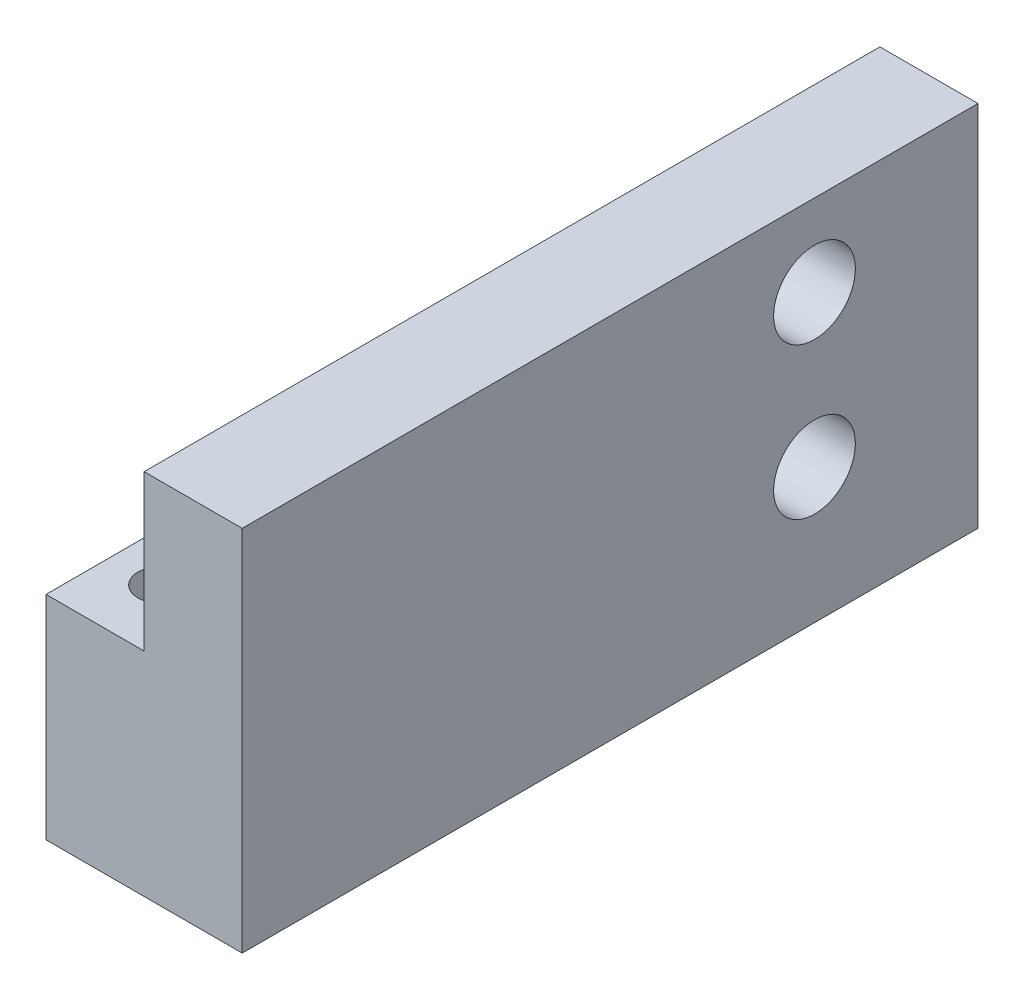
ISO-10303-21;
HEADER;
FILE_DESCRIPTION(('STEP AP214'),'2;1');
FILE_NAME('part.step','',(''),(''),'','','');
FILE_SCHEMA(('AUTOMOTIVE_DESIGN { 1 0 10303 214 1 1 1 1 }'));
ENDSEC;
DATA;
#1=APPLICATION_CONTEXT('core data for automotive mechanical design processes');
#2=APPLICATION_PROTOCOL_DEFINITION('international standard','automotive_design',2000,#1);
#3=PRODUCT_CONTEXT('',#1,'mechanical');
#4=PRODUCT('Part','Part','',(#3));
#5=PRODUCT_RELATED_PRODUCT_CATEGORY('part','',(#4));
#6=PRODUCT_DEFINITION_FORMATION('','',#4);
#7=PRODUCT_DEFINITION_CONTEXT('part definition',#1,'design');
#8=PRODUCT_DEFINITION('design','',#6,#7);
#9=PRODUCT_DEFINITION_SHAPE('','',#8);
#10=(LENGTH_UNIT() NAMED_UNIT(*) SI_UNIT(.MILLI.,.METRE.));
#11=(NAMED_UNIT(*) PLANE_ANGLE_UNIT() SI_UNIT($,.RADIAN.));
#12=(NAMED_UNIT(*) SI_UNIT($,.STERADIAN.) SOLID_ANGLE_UNIT());
#13=UNCERTAINTY_MEASURE_WITH_UNIT(LENGTH_MEASURE(1.E-05),#10,'distance_accuracy_value','');
#14=(GEOMETRIC_REPRESENTATION_CONTEXT(3) GLOBAL_UNCERTAINTY_ASSIGNED_CONTEXT((#13)) GLOBAL_UNIT_ASSIGNED_CONTEXT((#10,
#11,#12)) REPRESENTATION_CONTEXT('',''));
#15=CARTESIAN_POINT('',(0.,0.,0.));
#16=DIRECTION('',(0.,0.,1.));
#17=DIRECTION('',(1.,0.,0.));
#18=AXIS2_PLACEMENT_3D('',#15,#16,#17);
#19=CARTESIAN_POINT('',(-6.,3.5,20.));
#20=DIRECTION('',(0.,1.,0.));
#21=DIRECTION('',(0.,0.,1.));
#22=AXIS2_PLACEMENT_3D('',#19,#20,#21);
#23=CYLINDRICAL_SURFACE('',#22,1.64999999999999);
#24=CARTESIAN_POINT('',(-6.,3.5,20.));
#25=DIRECTION('',(0.,1.,0.));
#26=DIRECTION('',(0.,0.,1.));
#27=AXIS2_PLACEMENT_3D('',#24,#25,#26);
#28=CIRCLE('',#27,1.64999999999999);
#29=CARTESIAN_POINT('',(-6.,3.5,21.65));
#30=VERTEX_POINT('',#29);
#31=EDGE_CURVE('E105',#30,#30,#28,.T.);
#32=ORIENTED_EDGE('',*,*,#31,.T.);
#33=EDGE_LOOP('',(#32));
#34=FACE_BOUND('',#33,.T.);
#35=CARTESIAN_POINT('',(-4.35000000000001,-0.999999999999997,20.));
#36=CARTESIAN_POINT('',(-4.35000378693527,-1.00000272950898,20.0900197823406));
#37=CARTESIAN_POINT('',(-4.35739630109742,-1.00245575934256,20.1800846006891));
#38=CARTESIAN_POINT('',(-4.38670360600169,-1.01201043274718,20.3576091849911));
#39=CARTESIAN_POINT('',(-4.40863108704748,-1.01911613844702,20.4450666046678));
#40=CARTESIAN_POINT('',(-4.46617396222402,-1.03720026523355,20.614724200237));
#41=CARTESIAN_POINT('',(-4.50176272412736,-1.04817114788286,20.696934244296));
#42=CARTESIAN_POINT('',(-4.58551147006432,-1.07286273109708,20.8542035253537));
#43=CARTESIAN_POINT('',(-4.63367179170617,-1.0865835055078,20.9292625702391));
#44=CARTESIAN_POINT('',(-4.74291936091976,-1.11585191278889,21.0726698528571));
#45=CARTESIAN_POINT('',(-4.80435762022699,-1.13144265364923,21.1407418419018));
#46=CARTESIAN_POINT('',(-4.93768628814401,-1.16245793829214,21.2658396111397));
#47=CARTESIAN_POINT('',(-5.00958092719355,-1.17788241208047,21.3228608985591));
#48=CARTESIAN_POINT('',(-5.16426535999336,-1.20729396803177,21.4258059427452));
#49=CARTESIAN_POINT('',(-5.24730704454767,-1.2212276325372,21.4713675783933));
#50=CARTESIAN_POINT('',(-5.42035974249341,-1.24540403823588,21.5477197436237));
#51=CARTESIAN_POINT('',(-5.51036197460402,-1.25565134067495,21.5785285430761));
#52=CARTESIAN_POINT('',(-5.66730933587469,-1.26882758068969,21.6174939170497));
#53=CARTESIAN_POINT('',(-5.73317964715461,-1.27302550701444,21.6296582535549));
#54=CARTESIAN_POINT('',(-5.86602497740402,-1.27866051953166,21.6459123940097));
#55=CARTESIAN_POINT('',(-5.9329998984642,-1.28009784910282,21.6500029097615));
#56=CARTESIAN_POINT('',(-6.08986951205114,-1.28009197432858,21.6499960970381));
#57=CARTESIAN_POINT('',(-6.17978432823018,-1.27749808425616,21.6426273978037));
#58=CARTESIAN_POINT('',(-6.35699665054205,-1.26744328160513,21.6134233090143));
#59=CARTESIAN_POINT('',(-6.44429168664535,-1.25997791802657,21.5915746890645));
#60=CARTESIAN_POINT('',(-6.61360460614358,-1.24111979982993,21.5342620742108));
#61=CARTESIAN_POINT('',(-6.69563371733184,-1.2297357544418,21.4988282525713));
#62=CARTESIAN_POINT('',(-6.85259401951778,-1.2043346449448,21.4154453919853));
#63=CARTESIAN_POINT('',(-6.92752482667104,-1.19031743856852,21.3674956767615));
#64=CARTESIAN_POINT('',(-7.07105050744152,-1.16062576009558,21.2584719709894));
#65=CARTESIAN_POINT('',(-7.13933433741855,-1.14491060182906,21.1969994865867));
#66=CARTESIAN_POINT('',(-7.26484842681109,-1.11393470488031,21.0635104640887));
#67=CARTESIAN_POINT('',(-7.32207483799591,-1.09867412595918,20.9914902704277));
#68=CARTESIAN_POINT('',(-7.42525766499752,-1.06985426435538,20.8366699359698));
#69=CARTESIAN_POINT('',(-7.47088388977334,-1.05634926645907,20.7536389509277));
#70=CARTESIAN_POINT('',(-7.54735861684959,-1.03306105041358,20.5806069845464));
#71=CARTESIAN_POINT('',(-7.57822470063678,-1.02327340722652,20.4906144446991));
#72=CARTESIAN_POINT('',(-7.61733057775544,-1.01070811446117,20.3335211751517));
#73=CARTESIAN_POINT('',(-7.62955663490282,-1.00671495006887,20.2674828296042));
#74=CARTESIAN_POINT('',(-7.6458924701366,-1.00135996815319,20.1343046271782));
#75=CARTESIAN_POINT('',(-7.65000282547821,-0.999997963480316,20.0671648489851));
#76=CARTESIAN_POINT('',(-7.64999621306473,-1.00000272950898,19.9099802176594));
#77=CARTESIAN_POINT('',(-7.64260369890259,-1.00245575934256,19.8199153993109));
#78=CARTESIAN_POINT('',(-7.61329639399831,-1.01201043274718,19.6423908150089));
#79=CARTESIAN_POINT('',(-7.59136891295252,-1.01911613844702,19.5549333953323));
#80=CARTESIAN_POINT('',(-7.53382603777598,-1.03720026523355,19.385275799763));
#81=CARTESIAN_POINT('',(-7.49823727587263,-1.04817114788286,19.303065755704));
#82=CARTESIAN_POINT('',(-7.41448852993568,-1.07286273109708,19.1457964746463));
#83=CARTESIAN_POINT('',(-7.36632820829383,-1.0865835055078,19.0707374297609));
#84=CARTESIAN_POINT('',(-7.25708063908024,-1.11585191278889,18.9273301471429));
#85=CARTESIAN_POINT('',(-7.19564237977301,-1.13144265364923,18.8592581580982));
#86=CARTESIAN_POINT('',(-7.06231371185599,-1.16245793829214,18.7341603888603));
#87=CARTESIAN_POINT('',(-6.99041907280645,-1.17788241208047,18.6771391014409));
#88=CARTESIAN_POINT('',(-6.83573464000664,-1.20729396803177,18.5741940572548));
#89=CARTESIAN_POINT('',(-6.75269295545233,-1.2212276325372,18.5286324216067));
#90=CARTESIAN_POINT('',(-6.57964025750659,-1.24540403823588,18.4522802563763));
#91=CARTESIAN_POINT('',(-6.48963802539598,-1.25565134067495,18.4214714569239));
#92=CARTESIAN_POINT('',(-6.33269066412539,-1.26882758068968,18.3825060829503));
#93=CARTESIAN_POINT('',(-6.26682035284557,-1.27302550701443,18.3703417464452));
#94=CARTESIAN_POINT('',(-6.13397502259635,-1.27866051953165,18.3540876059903));
#95=CARTESIAN_POINT('',(-6.06700010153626,-1.28009784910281,18.3499970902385));
#96=CARTESIAN_POINT('',(-5.91013048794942,-1.28009197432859,18.3500039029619));
#97=CARTESIAN_POINT('',(-5.82021567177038,-1.27749808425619,18.3573726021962));
#98=CARTESIAN_POINT('',(-5.64300334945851,-1.26744328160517,18.3865766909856));
#99=CARTESIAN_POINT('',(-5.5557083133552,-1.25997791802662,18.4084253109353));
#100=CARTESIAN_POINT('',(-5.38639539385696,-1.24111979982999,18.465737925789));
#101=CARTESIAN_POINT('',(-5.30436628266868,-1.22973575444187,18.5011717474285));
#102=CARTESIAN_POINT('',(-5.14740598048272,-1.20433464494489,18.5845546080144));
#103=CARTESIAN_POINT('',(-5.07247517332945,-1.19031743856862,18.6325043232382));
#104=CARTESIAN_POINT('',(-4.92894949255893,-1.16062576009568,18.7415280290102));
#105=CARTESIAN_POINT('',(-4.86066566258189,-1.14491060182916,18.8030005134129));
#106=CARTESIAN_POINT('',(-4.7351515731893,-1.11393470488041,18.9364895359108));
#107=CARTESIAN_POINT('',(-4.67792516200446,-1.09867412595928,19.0085097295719));
#108=CARTESIAN_POINT('',(-4.5747423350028,-1.06985426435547,19.1633300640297));
#109=CARTESIAN_POINT('',(-4.52911611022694,-1.05634926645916,19.2463610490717));
#110=CARTESIAN_POINT('',(-4.45264138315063,-1.03306105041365,19.419393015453));
#111=CARTESIAN_POINT('',(-4.4217752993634,-1.02327340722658,19.5093855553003));
#112=CARTESIAN_POINT('',(-4.38266942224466,-1.0107081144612,19.6664788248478));
#113=CARTESIAN_POINT('',(-4.37044336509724,-1.00671495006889,19.7325171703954));
#114=CARTESIAN_POINT('',(-4.35410752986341,-1.00135996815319,19.8656953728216));
#115=CARTESIAN_POINT('',(-4.34999717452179,-0.999997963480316,19.9328351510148));
#116=CARTESIAN_POINT('',(-4.35000000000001,-0.999999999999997,20.));
#117=B_SPLINE_CURVE_WITH_KNOTS('',3,(#35,#36,#37,#38,#39,#40,#41,#42,#43,#44,#45,#46,#47,#48,
#49,#50,#51,#52,#53,#54,#55,#56,#57,#58,#59,#60,#61,#62,#63,#64,#65,#66,#67,#68,#69,#70,#71,#72,
#73,#74,#75,#76,#77,#78,#79,#80,#81,#82,#83,#84,#85,#86,#87,#88,#89,#90,#91,#92,#93,#94,#95,#96,
#97,#98,#99,#100,#101,#102,#103,#104,#105,#106,#107,#108,#109,#110,#111,#112,#113,#114,#115,
#116),.UNSPECIFIED.,.T.,.F.,(4,2,2,2,2,2,2,2,2,2,2,2,2,2,2,2,2,2,2,2,2,2,2,2,2,2,2,2,2,2,2,2,2,
2,2,2,2,2,2,2,4),(0.,0.269807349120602,0.539850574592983,0.809370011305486,1.07889668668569,
1.35668555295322,1.63458712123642,1.92039970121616,2.20585741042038,2.40668679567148,
2.6074984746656,2.87685400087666,3.14645597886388,3.41546259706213,3.68448375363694,
3.96286239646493,4.24133774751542,4.52702385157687,4.81236880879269,5.01368965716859,
5.21499618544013,5.48480353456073,5.75484676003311,6.02436619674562,6.29389287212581,
6.57168173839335,6.84958330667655,7.13539588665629,7.42085359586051,7.62168298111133,
7.82249466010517,8.09185018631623,8.36145216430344,8.63045878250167,8.89947993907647,
9.17785858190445,9.45633393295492,9.74202003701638,10.0273649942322,10.2286858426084,
10.4299923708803),.UNSPECIFIED.);
#118=CARTESIAN_POINT('',(-4.35000000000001,-0.999999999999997,20.));
#119=VERTEX_POINT('',#118);
#120=EDGE_CURVE('E125',#119,#119,#117,.T.);
#121=ORIENTED_EDGE('',*,*,#120,.T.);
#122=EDGE_LOOP('',(#121));
#123=FACE_BOUND('',#122,.T.);
#124=ADVANCED_FACE('F17',(#34,#123),#23,.F.);
#125=CARTESIAN_POINT('',(-5.99999999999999,-22.5,82.));
#126=DIRECTION('',(0.,1.,0.));
#127=DIRECTION('',(0.,0.,1.));
#128=AXIS2_PLACEMENT_3D('',#125,#126,#127);
#129=CYLINDRICAL_SURFACE('',#128,2.75);
#130=CARTESIAN_POINT('',(-5.99999999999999,-22.5,82.));
#131=DIRECTION('',(0.,1.,0.));
#132=DIRECTION('',(0.,0.,1.));
#133=AXIS2_PLACEMENT_3D('',#130,#131,#132);
#134=CIRCLE('',#133,2.75);
#135=CARTESIAN_POINT('',(-5.99999999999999,-22.5,84.75));
#136=VERTEX_POINT('',#135);
#137=EDGE_CURVE('E119',#136,#136,#134,.F.);
#138=ORIENTED_EDGE('',*,*,#137,.T.);
#139=EDGE_LOOP('',(#138));
#140=FACE_BOUND('',#139,.T.);
#141=CARTESIAN_POINT('',(-5.99999999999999,3.5,82.));
#142=DIRECTION('',(0.,1.,0.));
#143=DIRECTION('',(0.,0.,1.));
#144=AXIS2_PLACEMENT_3D('',#141,#142,#143);
#145=CIRCLE('',#144,2.75);
#146=CARTESIAN_POINT('',(-5.99999999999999,3.5,84.75));
#147=VERTEX_POINT('',#146);
#148=EDGE_CURVE('E21',#147,#147,#145,.T.);
#149=ORIENTED_EDGE('',*,*,#148,.T.);
#150=EDGE_LOOP('',(#149));
#151=FACE_BOUND('',#150,.T.);
#152=ADVANCED_FACE('F158',(#140,#151),#129,.F.);
#153=CARTESIAN_POINT('',(-6.,-22.5,45.));
#154=DIRECTION('',(0.,1.,0.));
#155=DIRECTION('',(0.,0.,1.));
#156=AXIS2_PLACEMENT_3D('',#153,#154,#155);
#157=CYLINDRICAL_SURFACE('',#156,2.75);
#158=CARTESIAN_POINT('',(-6.,-22.5,45.));
#159=DIRECTION('',(0.,1.,0.));
#160=DIRECTION('',(0.,0.,1.));
#161=AXIS2_PLACEMENT_3D('',#158,#159,#160);
#162=CIRCLE('',#161,2.75);
#163=CARTESIAN_POINT('',(-6.,-22.5,47.75));
#164=VERTEX_POINT('',#163);
#165=EDGE_CURVE('E116',#164,#164,#162,.F.);
#166=ORIENTED_EDGE('',*,*,#165,.T.);
#167=EDGE_LOOP('',(#166));
#168=FACE_BOUND('',#167,.T.);
#169=CARTESIAN_POINT('',(-6.,3.5,45.));
#170=DIRECTION('',(0.,1.,0.));
#171=DIRECTION('',(0.,0.,1.));
#172=AXIS2_PLACEMENT_3D('',#169,#170,#171);
#173=CIRCLE('',#172,2.75);
#174=CARTESIAN_POINT('',(-6.,3.5,47.75));
#175=VERTEX_POINT('',#174);
#176=EDGE_CURVE('E202',#175,#175,#173,.T.);
#177=ORIENTED_EDGE('',*,*,#176,.T.);
#178=EDGE_LOOP('',(#177));
#179=FACE_BOUND('',#178,.T.);
#180=ADVANCED_FACE('F155',(#168,#179),#157,.F.);
#181=CARTESIAN_POINT('',(-6.,-22.5,8.));
#182=DIRECTION('',(0.,1.,0.));
#183=DIRECTION('',(0.,0.,1.));
#184=AXIS2_PLACEMENT_3D('',#181,#182,#183);
#185=CYLINDRICAL_SURFACE('',#184,2.75);
#186=CARTESIAN_POINT('',(-6.,-22.5,8.));
#187=DIRECTION('',(0.,1.,0.));
#188=DIRECTION('',(0.,0.,1.));
#189=AXIS2_PLACEMENT_3D('',#186,#187,#188);
#190=CIRCLE('',#189,2.75);
#191=CARTESIAN_POINT('',(-6.,-22.5,10.75));
#192=VERTEX_POINT('',#191);
#193=EDGE_CURVE('E102',#192,#192,#190,.F.);
#194=ORIENTED_EDGE('',*,*,#193,.T.);
#195=EDGE_LOOP('',(#194));
#196=FACE_BOUND('',#195,.T.);
#197=CARTESIAN_POINT('',(-6.,3.5,8.));
#198=DIRECTION('',(0.,1.,0.));
#199=DIRECTION('',(0.,0.,1.));
#200=AXIS2_PLACEMENT_3D('',#197,#198,#199);
#201=CIRCLE('',#200,2.75);
#202=CARTESIAN_POINT('',(-6.,3.5,10.75));
#203=VERTEX_POINT('',#202);
#204=EDGE_CURVE('E204',#203,#203,#201,.T.);
#205=ORIENTED_EDGE('',*,*,#204,.T.);
#206=EDGE_LOOP('',(#205));
#207=FACE_BOUND('',#206,.T.);
#208=ADVANCED_FACE('F151',(#196,#207),#185,.F.);
#209=CARTESIAN_POINT('',(-12.,22.5,90.));
#210=DIRECTION('',(1.,0.,0.));
#211=DIRECTION('',(0.,1.,0.));
#212=AXIS2_PLACEMENT_3D('',#209,#210,#211);
#213=PLANE('',#212);
#214=DIRECTION('',(0.,0.,-1.));
#215=VECTOR('',#214,1.);
#216=CARTESIAN_POINT('',(-12.,3.5,0.));
#217=LINE('',#216,#215);
#218=CARTESIAN_POINT('',(-12.,3.5,90.));
#219=VERTEX_POINT('',#218);
#220=CARTESIAN_POINT('',(-12.,3.5,0.));
#221=VERTEX_POINT('',#220);
#222=EDGE_CURVE('E69',#219,#221,#217,.T.);
#223=ORIENTED_EDGE('',*,*,#222,.T.);
#224=DIRECTION('',(0.,1.,0.));
#225=VECTOR('',#224,1.);
#226=CARTESIAN_POINT('',(-12.,0.,0.));
#227=LINE('',#226,#225);
#228=CARTESIAN_POINT('',(-12.,-22.5,0.));
#229=VERTEX_POINT('',#228);
#230=EDGE_CURVE('E239',#221,#229,#227,.F.);
#231=ORIENTED_EDGE('',*,*,#230,.T.);
#232=DIRECTION('',(0.,0.,1.));
#233=VECTOR('',#232,1.);
#234=CARTESIAN_POINT('',(-12.,-22.5,90.));
#235=LINE('',#234,#233);
#236=CARTESIAN_POINT('',(-12.,-22.5,90.));
#237=VERTEX_POINT('',#236);
#238=EDGE_CURVE('E83',#229,#237,#235,.T.);
#239=ORIENTED_EDGE('',*,*,#238,.T.);
#240=DIRECTION('',(0.,1.,0.));
#241=VECTOR('',#240,1.);
#242=CARTESIAN_POINT('',(-12.,0.,90.));
#243=LINE('',#242,#241);
#244=EDGE_CURVE('E95',#219,#237,#243,.F.);
#245=ORIENTED_EDGE('',*,*,#244,.F.);
#246=EDGE_LOOP('',(#223,#231,#239,#245));
#247=FACE_BOUND('',#246,.T.);
#248=CARTESIAN_POINT('',(-12.,-6.,20.));
#249=DIRECTION('',(1.,0.,0.));
#250=DIRECTION('',(0.,1.,0.));
#251=AXIS2_PLACEMENT_3D('',#248,#249,#250);
#252=CIRCLE('',#251,5.);
#253=CARTESIAN_POINT('',(-12.,-0.999999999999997,20.));
#254=VERTEX_POINT('',#253);
#255=EDGE_CURVE('E122',#254,#254,#252,.T.);
#256=ORIENTED_EDGE('',*,*,#255,.T.);
#257=EDGE_LOOP('',(#256));
#258=FACE_BOUND('',#257,.T.);
#259=ADVANCED_FACE('F148',(#247,#258),#213,.F.);
#260=CARTESIAN_POINT('',(0.,22.5,0.));
#261=DIRECTION('',(1.,0.,0.));
#262=DIRECTION('',(0.,1.,0.));
#263=AXIS2_PLACEMENT_3D('',#260,#261,#262);
#264=PLANE('',#263);
#265=DIRECTION('',(0.,0.,-1.));
#266=VECTOR('',#265,1.);
#267=CARTESIAN_POINT('',(0.,22.5,90.));
#268=LINE('',#267,#266);
#269=CARTESIAN_POINT('',(0.,22.5,90.));
#270=VERTEX_POINT('',#269);
#271=CARTESIAN_POINT('',(0.,22.5,0.));
#272=VERTEX_POINT('',#271);
#273=EDGE_CURVE('E242',#270,#272,#268,.T.);
#274=ORIENTED_EDGE('',*,*,#273,.T.);
#275=DIRECTION('',(0.,1.,0.));
#276=VECTOR('',#275,1.);
#277=CARTESIAN_POINT('',(0.,0.,0.));
#278=LINE('',#277,#276);
#279=CARTESIAN_POINT('',(0.,3.5,0.));
#280=VERTEX_POINT('',#279);
#281=EDGE_CURVE('E89',#272,#280,#278,.F.);
#282=ORIENTED_EDGE('',*,*,#281,.T.);
#283=DIRECTION('',(0.,0.,-1.));
#284=VECTOR('',#283,1.);
#285=CARTESIAN_POINT('',(0.,3.5,0.));
#286=LINE('',#285,#284);
#287=CARTESIAN_POINT('',(0.,3.5,90.));
#288=VERTEX_POINT('',#287);
#289=EDGE_CURVE('E86',#280,#288,#286,.F.);
#290=ORIENTED_EDGE('',*,*,#289,.T.);
#291=DIRECTION('',(0.,1.,0.));
#292=VECTOR('',#291,1.);
#293=CARTESIAN_POINT('',(0.,0.,90.));
#294=LINE('',#293,#292);
#295=EDGE_CURVE('E74',#270,#288,#294,.F.);
#296=ORIENTED_EDGE('',*,*,#295,.F.);
#297=EDGE_LOOP('',(#274,#282,#290,#296));
#298=FACE_BOUND('',#297,.T.);
#299=CARTESIAN_POINT('',(0.,12.5,20.));
#300=DIRECTION('',(-1.,0.,0.));
#301=DIRECTION('',(0.,-1.,0.));
#302=AXIS2_PLACEMENT_3D('',#299,#300,#301);
#303=CIRCLE('',#302,5.);
#304=CARTESIAN_POINT('',(0.,7.49999999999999,20.));
#305=VERTEX_POINT('',#304);
#306=EDGE_CURVE('E91',#305,#305,#303,.F.);
#307=ORIENTED_EDGE('',*,*,#306,.T.);
#308=EDGE_LOOP('',(#307));
#309=FACE_BOUND('',#308,.T.);
#310=ADVANCED_FACE('F87',(#298,#309),#264,.F.);
#311=CARTESIAN_POINT('',(-12.,3.5,0.));
#312=DIRECTION('',(0.,-1.,0.));
#313=DIRECTION('',(0.,0.,-1.));
#314=AXIS2_PLACEMENT_3D('',#311,#312,#313);
#315=PLANE('',#314);
#316=ORIENTED_EDGE('',*,*,#289,.F.);
#317=DIRECTION('',(1.,0.,0.));
#318=VECTOR('',#317,1.);
#319=CARTESIAN_POINT('',(0.,3.5,0.));
#320=LINE('',#319,#318);
#321=EDGE_CURVE('E113',#280,#221,#320,.F.);
#322=ORIENTED_EDGE('',*,*,#321,.T.);
#323=ORIENTED_EDGE('',*,*,#222,.F.);
#324=DIRECTION('',(1.,0.,0.));
#325=VECTOR('',#324,1.);
#326=CARTESIAN_POINT('',(0.,3.5,90.));
#327=LINE('',#326,#325);
#328=EDGE_CURVE('E78',#288,#219,#327,.F.);
#329=ORIENTED_EDGE('',*,*,#328,.F.);
#330=EDGE_LOOP('',(#316,#322,#323,#329));
#331=FACE_BOUND('',#330,.T.);
#332=ORIENTED_EDGE('',*,*,#31,.F.);
#333=EDGE_LOOP('',(#332));
#334=FACE_BOUND('',#333,.T.);
#335=ORIENTED_EDGE('',*,*,#204,.F.);
#336=EDGE_LOOP('',(#335));
#337=FACE_BOUND('',#336,.T.);
#338=ORIENTED_EDGE('',*,*,#176,.F.);
#339=EDGE_LOOP('',(#338));
#340=FACE_BOUND('',#339,.T.);
#341=ORIENTED_EDGE('',*,*,#148,.F.);
#342=EDGE_LOOP('',(#341));
#343=FACE_BOUND('',#342,.T.);
#344=ADVANCED_FACE('F93',(#331,#334,#337,#340,#343),#315,.F.);
#345=CARTESIAN_POINT('',(12.,12.5,20.));
#346=DIRECTION('',(-1.,0.,0.));
#347=DIRECTION('',(0.,-1.,0.));
#348=AXIS2_PLACEMENT_3D('',#345,#346,#347);
#349=CYLINDRICAL_SURFACE('',#348,5.);
#350=CARTESIAN_POINT('',(12.,12.5,20.));
#351=DIRECTION('',(-1.,0.,0.));
#352=DIRECTION('',(0.,-1.,0.));
#353=AXIS2_PLACEMENT_3D('',#350,#351,#352);
#354=CIRCLE('',#353,5.);
#355=CARTESIAN_POINT('',(12.,7.49999999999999,20.));
#356=VERTEX_POINT('',#355);
#357=EDGE_CURVE('E110',#356,#356,#354,.F.);
#358=ORIENTED_EDGE('',*,*,#357,.T.);
#359=EDGE_LOOP('',(#358));
#360=FACE_BOUND('',#359,.T.);
#361=ORIENTED_EDGE('',*,*,#306,.F.);
#362=EDGE_LOOP('',(#361));
#363=FACE_BOUND('',#362,.T.);
#364=ADVANCED_FACE('F138',(#360,#363),#349,.F.);
#365=CARTESIAN_POINT('',(-12.,-6.,20.));
#366=DIRECTION('',(1.,0.,0.));
#367=DIRECTION('',(0.,1.,0.));
#368=AXIS2_PLACEMENT_3D('',#365,#366,#367);
#369=CYLINDRICAL_SURFACE('',#368,5.);
#370=ORIENTED_EDGE('',*,*,#120,.F.);
#371=EDGE_LOOP('',(#370));
#372=FACE_BOUND('',#371,.T.);
#373=ORIENTED_EDGE('',*,*,#255,.F.);
#374=EDGE_LOOP('',(#373));
#375=FACE_BOUND('',#374,.T.);
#376=CARTESIAN_POINT('',(12.,-6.,20.));
#377=DIRECTION('',(1.,0.,0.));
#378=DIRECTION('',(0.,1.,0.));
#379=AXIS2_PLACEMENT_3D('',#376,#377,#378);
#380=CIRCLE('',#379,5.);
#381=CARTESIAN_POINT('',(12.,-0.999999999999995,20.));
#382=VERTEX_POINT('',#381);
#383=EDGE_CURVE('E106',#382,#382,#380,.T.);
#384=ORIENTED_EDGE('',*,*,#383,.T.);
#385=EDGE_LOOP('',(#384));
#386=FACE_BOUND('',#385,.T.);
#387=ADVANCED_FACE('F132',(#372,#375,#386),#369,.F.);
#388=CARTESIAN_POINT('',(-12.,-22.5,90.));
#389=DIRECTION('',(0.,1.,0.));
#390=DIRECTION('',(0.,0.,1.));
#391=AXIS2_PLACEMENT_3D('',#388,#389,#390);
#392=PLANE('',#391);
#393=DIRECTION('',(0.,0.,1.));
#394=VECTOR('',#393,1.);
#395=CARTESIAN_POINT('',(12.,-22.5,90.));
#396=LINE('',#395,#394);
#397=CARTESIAN_POINT('',(12.,-22.5,0.));
#398=VERTEX_POINT('',#397);
#399=CARTESIAN_POINT('',(12.,-22.5,90.));
#400=VERTEX_POINT('',#399);
#401=EDGE_CURVE('E109',#398,#400,#396,.T.);
#402=ORIENTED_EDGE('',*,*,#401,.T.);
#403=DIRECTION('',(1.,0.,0.));
#404=VECTOR('',#403,1.);
#405=CARTESIAN_POINT('',(0.,-22.5,90.));
#406=LINE('',#405,#404);
#407=EDGE_CURVE('E97',#237,#400,#406,.T.);
#408=ORIENTED_EDGE('',*,*,#407,.F.);
#409=ORIENTED_EDGE('',*,*,#238,.F.);
#410=DIRECTION('',(1.,0.,0.));
#411=VECTOR('',#410,1.);
#412=CARTESIAN_POINT('',(0.,-22.5,0.));
#413=LINE('',#412,#411);
#414=EDGE_CURVE('E228',#229,#398,#413,.T.);
#415=ORIENTED_EDGE('',*,*,#414,.T.);
#416=EDGE_LOOP('',(#402,#408,#409,#415));
#417=FACE_BOUND('',#416,.T.);
#418=ORIENTED_EDGE('',*,*,#193,.F.);
#419=EDGE_LOOP('',(#418));
#420=FACE_BOUND('',#419,.T.);
#421=ORIENTED_EDGE('',*,*,#165,.F.);
#422=EDGE_LOOP('',(#421));
#423=FACE_BOUND('',#422,.T.);
#424=ORIENTED_EDGE('',*,*,#137,.F.);
#425=EDGE_LOOP('',(#424));
#426=FACE_BOUND('',#425,.T.);
#427=ADVANCED_FACE('F137',(#417,#420,#423,#426),#392,.F.);
#428=CARTESIAN_POINT('',(0.,0.,90.));
#429=DIRECTION('',(0.,0.,1.));
#430=DIRECTION('',(1.,0.,0.));
#431=AXIS2_PLACEMENT_3D('',#428,#429,#430);
#432=PLANE('',#431);
#433=DIRECTION('',(0.,-1.,0.));
#434=VECTOR('',#433,1.);
#435=CARTESIAN_POINT('',(12.,22.5,90.));
#436=LINE('',#435,#434);
#437=CARTESIAN_POINT('',(12.,22.5,90.));
#438=VERTEX_POINT('',#437);
#439=EDGE_CURVE('E230',#400,#438,#436,.F.);
#440=ORIENTED_EDGE('',*,*,#439,.T.);
#441=DIRECTION('',(1.,0.,0.));
#442=VECTOR('',#441,1.);
#443=CARTESIAN_POINT('',(-12.,22.5,90.));
#444=LINE('',#443,#442);
#445=EDGE_CURVE('E80',#438,#270,#444,.F.);
#446=ORIENTED_EDGE('',*,*,#445,.T.);
#447=ORIENTED_EDGE('',*,*,#295,.T.);
#448=ORIENTED_EDGE('',*,*,#328,.T.);
#449=ORIENTED_EDGE('',*,*,#244,.T.);
#450=ORIENTED_EDGE('',*,*,#407,.T.);
#451=EDGE_LOOP('',(#440,#446,#447,#448,#449,#450));
#452=FACE_BOUND('',#451,.T.);
#453=ADVANCED_FACE('F77',(#452),#432,.T.);
#454=CARTESIAN_POINT('',(-12.,22.5,90.));
#455=DIRECTION('',(0.,-1.,0.));
#456=DIRECTION('',(0.,0.,-1.));
#457=AXIS2_PLACEMENT_3D('',#454,#455,#456);
#458=PLANE('',#457);
#459=ORIENTED_EDGE('',*,*,#273,.F.);
#460=ORIENTED_EDGE('',*,*,#445,.F.);
#461=DIRECTION('',(0.,0.,1.));
#462=VECTOR('',#461,1.);
#463=CARTESIAN_POINT('',(12.,22.5,90.));
#464=LINE('',#463,#462);
#465=CARTESIAN_POINT('',(12.,22.5,0.));
#466=VERTEX_POINT('',#465);
#467=EDGE_CURVE('E27',#438,#466,#464,.F.);
#468=ORIENTED_EDGE('',*,*,#467,.T.);
#469=DIRECTION('',(1.,0.,0.));
#470=VECTOR('',#469,1.);
#471=CARTESIAN_POINT('',(0.,22.5,0.));
#472=LINE('',#471,#470);
#473=EDGE_CURVE('E35',#466,#272,#472,.F.);
#474=ORIENTED_EDGE('',*,*,#473,.T.);
#475=EDGE_LOOP('',(#459,#460,#468,#474));
#476=FACE_BOUND('',#475,.T.);
#477=ADVANCED_FACE('F176',(#476),#458,.F.);
#478=CARTESIAN_POINT('',(0.,0.,0.));
#479=DIRECTION('',(0.,0.,1.));
#480=DIRECTION('',(1.,0.,0.));
#481=AXIS2_PLACEMENT_3D('',#478,#479,#480);
#482=PLANE('',#481);
#483=ORIENTED_EDGE('',*,*,#281,.F.);
#484=ORIENTED_EDGE('',*,*,#473,.F.);
#485=DIRECTION('',(0.,-1.,0.));
#486=VECTOR('',#485,1.);
#487=CARTESIAN_POINT('',(12.,22.5,0.));
#488=LINE('',#487,#486);
#489=EDGE_CURVE('E11',#466,#398,#488,.T.);
#490=ORIENTED_EDGE('',*,*,#489,.T.);
#491=ORIENTED_EDGE('',*,*,#414,.F.);
#492=ORIENTED_EDGE('',*,*,#230,.F.);
#493=ORIENTED_EDGE('',*,*,#321,.F.);
#494=EDGE_LOOP('',(#483,#484,#490,#491,#492,#493));
#495=FACE_BOUND('',#494,.T.);
#496=ADVANCED_FACE('F170',(#495),#482,.F.);
#497=CARTESIAN_POINT('',(12.,22.5,90.));
#498=DIRECTION('',(-1.,0.,0.));
#499=DIRECTION('',(0.,-1.,0.));
#500=AXIS2_PLACEMENT_3D('',#497,#498,#499);
#501=PLANE('',#500);
#502=ORIENTED_EDGE('',*,*,#467,.F.);
#503=ORIENTED_EDGE('',*,*,#439,.F.);
#504=ORIENTED_EDGE('',*,*,#401,.F.);
#505=ORIENTED_EDGE('',*,*,#489,.F.);
#506=EDGE_LOOP('',(#502,#503,#504,#505));
#507=FACE_BOUND('',#506,.T.);
#508=ORIENTED_EDGE('',*,*,#383,.F.);
#509=EDGE_LOOP('',(#508));
#510=FACE_BOUND('',#509,.T.);
#511=ORIENTED_EDGE('',*,*,#357,.F.);
#512=EDGE_LOOP('',(#511));
#513=FACE_BOUND('',#512,.T.);
#514=ADVANCED_FACE('F168',(#507,#510,#513),#501,.F.);
#515=CLOSED_SHELL('',(#124,#152,#180,#208,#259,#310,#344,#364,#387,#427,#453,#477,#496,#514));
#516=MANIFOLD_SOLID_BREP('B1',#515);
#517=ADVANCED_BREP_SHAPE_REPRESENTATION('',(#18,#516),#14);
#518=SHAPE_DEFINITION_REPRESENTATION(#9,#517);
ENDSEC;
END-ISO-10303-21;
